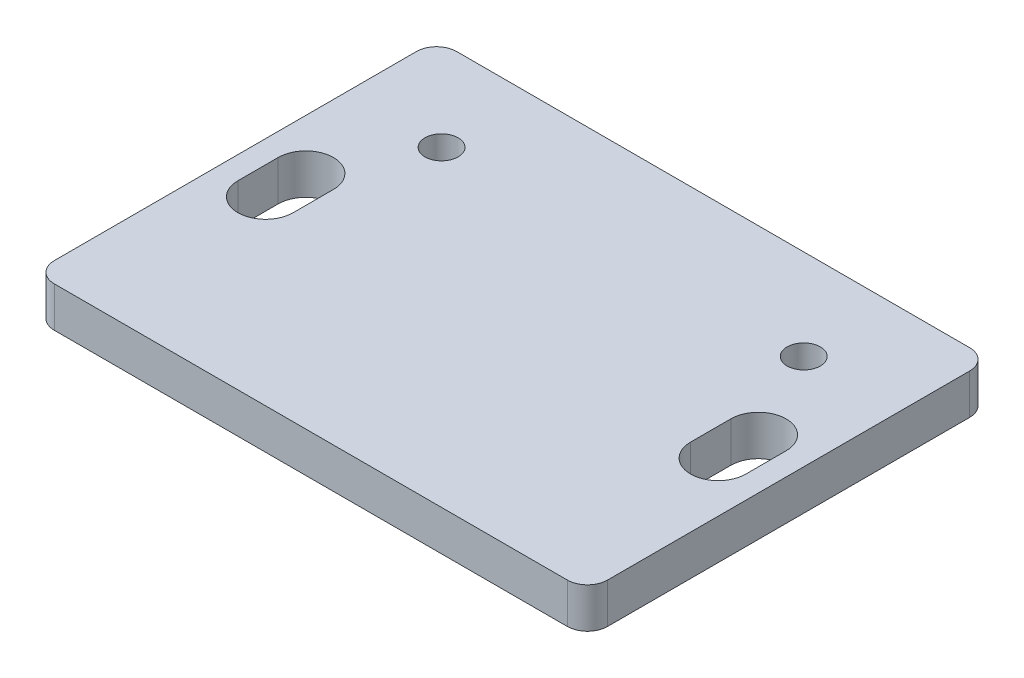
from build123d import *

# Parameters (mm, degrees)
SKIZZE1_W                       = 55
SKIZZE1_H                       = 40
AUFSATZ_LINEAR_AUSTRAGEN1_DEPTH = 4
M4_GEWINDEBOHRUNG1_D            = 3.3
SCHNITT_LINEAR_AUSTRAGEN1_DEPTH = 35.238136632
VERRUNDUNG1_R                   = 2


with BuildPart() as part:
    # Skizze1 → Aufsatz-Linear austragen1 (new body)
    with BuildSketch(Plane(origin=(0, 0, 0), x_dir=(1, 0, 0), z_dir=(0, 1, 0))):
        Rectangle(SKIZZE1_W, SKIZZE1_H)
    extrude(amount=AUFSATZ_LINEAR_AUSTRAGEN1_DEPTH)

    # M4 Gewindebohrung1 (through all)
    with Locations(Plane(origin=(0, 4, 0), x_dir=(1, 0, 0), z_dir=(0, 1, 0))):
        with Locations((-18, 11), (18, 11)):
            Hole(M4_GEWINDEBOHRUNG1_D / 2)

    # Skizze4 → Schnitt-Linear austragen1 (cut, through all)
    with BuildSketch(Plane(origin=(0, 4, 0), x_dir=(1, 0, 0), z_dir=(0, 1, 0))):
        with BuildLine():
            Line((-25.25, -2), (-25.25, 2))
            ThreePointArc((-25.25, 2), (-22.5, 4.75), (-19.75, 2))
            Line((-19.75, 2), (-19.75, -2))
            ThreePointArc((-19.75, -2), (-22.5, -4.75), (-25.25, -2))
        make_face()
        with BuildLine():
            Line((19.75, -2), (19.75, 2))
            ThreePointArc((19.75, 2), (22.5, 4.75), (25.25, 2))
            Line((25.25, 2), (25.25, -2))
            ThreePointArc((25.25, -2), (22.5, -4.75), (19.75, -2))
        make_face()
    extrude(amount=-SCHNITT_LINEAR_AUSTRAGEN1_DEPTH, mode=Mode.SUBTRACT)

    # Verrundung1
    verrundung1_edges = [part.edges().sort_by_distance(p)[0] for p in [
        (27.5, 2, 20),
        (-27.5, 2, 20),
        (-27.5, 2, -20),
        (27.5, 2, -20),
    ]]
    fillet(verrundung1_edges, radius=VERRUNDUNG1_R)


solid = part.part
